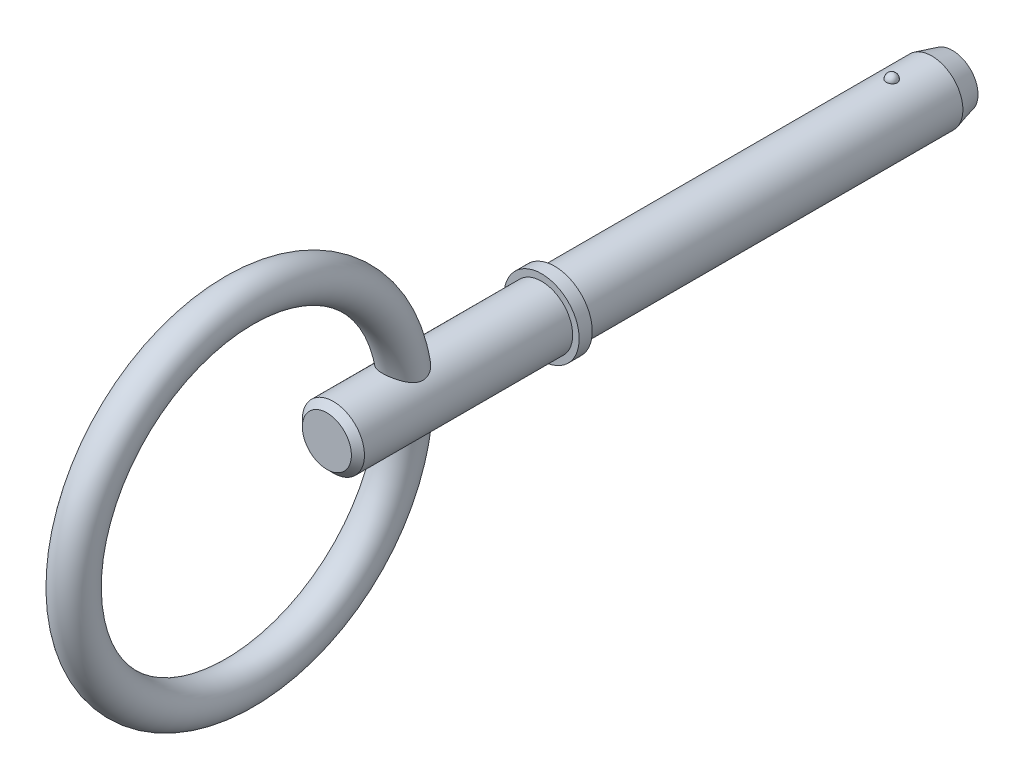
ISO-10303-21;
HEADER;
FILE_DESCRIPTION(('STEP AP214'),'2;1');
FILE_NAME('part.step','',(''),(''),'','','');
FILE_SCHEMA(('AUTOMOTIVE_DESIGN { 1 0 10303 214 1 1 1 1 }'));
ENDSEC;
DATA;
#1=APPLICATION_CONTEXT('core data for automotive mechanical design processes');
#2=APPLICATION_PROTOCOL_DEFINITION('international standard','automotive_design',2000,#1);
#3=PRODUCT_CONTEXT('',#1,'mechanical');
#4=PRODUCT('Part','Part','',(#3));
#5=PRODUCT_RELATED_PRODUCT_CATEGORY('part','',(#4));
#6=PRODUCT_DEFINITION_FORMATION('','',#4);
#7=PRODUCT_DEFINITION_CONTEXT('part definition',#1,'design');
#8=PRODUCT_DEFINITION('design','',#6,#7);
#9=PRODUCT_DEFINITION_SHAPE('','',#8);
#10=(LENGTH_UNIT() NAMED_UNIT(*) SI_UNIT(.MILLI.,.METRE.));
#11=(NAMED_UNIT(*) PLANE_ANGLE_UNIT() SI_UNIT($,.RADIAN.));
#12=(NAMED_UNIT(*) SI_UNIT($,.STERADIAN.) SOLID_ANGLE_UNIT());
#13=UNCERTAINTY_MEASURE_WITH_UNIT(LENGTH_MEASURE(1.E-05),#10,'distance_accuracy_value','');
#14=(GEOMETRIC_REPRESENTATION_CONTEXT(3) GLOBAL_UNCERTAINTY_ASSIGNED_CONTEXT((#13)) GLOBAL_UNIT_ASSIGNED_CONTEXT((#10,
#11,#12)) REPRESENTATION_CONTEXT('',''));
#15=CARTESIAN_POINT('',(0.,0.,0.));
#16=DIRECTION('',(0.,0.,1.));
#17=DIRECTION('',(1.,0.,0.));
#18=AXIS2_PLACEMENT_3D('',#15,#16,#17);
#19=CARTESIAN_POINT('',(0.,0.,25.4));
#20=DIRECTION('',(0.,0.,-1.));
#21=DIRECTION('',(-1.,0.,0.));
#22=AXIS2_PLACEMENT_3D('',#19,#20,#21);
#23=CYLINDRICAL_SURFACE('',#22,2.38);
#24=CARTESIAN_POINT('',(0.418361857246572,2.34294117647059,-0.419999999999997));
#25=CARTESIAN_POINT('',(0.418361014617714,2.34294160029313,-0.396453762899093));
#26=CARTESIAN_POINT('',(0.416399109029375,2.34329426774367,-0.372895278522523));
#27=CARTESIAN_POINT('',(0.408599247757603,2.34466666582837,-0.32643458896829));
#28=CARTESIAN_POINT('',(0.402757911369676,2.34568697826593,-0.303532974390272));
#29=CARTESIAN_POINT('',(0.387358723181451,2.3482789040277,-0.259059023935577));
#30=CARTESIAN_POINT('',(0.377802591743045,2.34985026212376,-0.237486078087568));
#31=CARTESIAN_POINT('',(0.355233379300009,2.35336760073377,-0.196270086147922));
#32=CARTESIAN_POINT('',(0.34222083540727,2.3553135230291,-0.176626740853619));
#33=CARTESIAN_POINT('',(0.313060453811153,2.35936636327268,-0.139777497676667));
#34=CARTESIAN_POINT('',(0.296906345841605,2.36147359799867,-0.122576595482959));
#35=CARTESIAN_POINT('',(0.261921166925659,2.3656092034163,-0.0911421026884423));
#36=CARTESIAN_POINT('',(0.243090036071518,2.36763757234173,-0.0769085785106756));
#37=CARTESIAN_POINT('',(0.203297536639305,2.37138533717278,-0.0518262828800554));
#38=CARTESIAN_POINT('',(0.182338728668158,2.37310509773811,-0.0409735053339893));
#39=CARTESIAN_POINT('',(0.138864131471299,2.37604521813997,-0.0229395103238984));
#40=CARTESIAN_POINT('',(0.116348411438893,2.37726560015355,-0.0157581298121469));
#41=CARTESIAN_POINT('',(0.0705754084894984,2.37906276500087,-0.00531205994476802));
#42=CARTESIAN_POINT('',(0.0473247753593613,2.37964420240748,-0.00201903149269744));
#43=CARTESIAN_POINT('',(0.000593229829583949,2.38011460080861,0.000651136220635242));
#44=CARTESIAN_POINT('',(-0.0228876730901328,2.38000359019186,2.84360175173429E-05));
#45=CARTESIAN_POINT('',(-0.0692686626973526,2.37910422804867,-0.00509943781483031));
#46=CARTESIAN_POINT('',(-0.0921713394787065,2.37831983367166,-0.00958192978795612));
#47=CARTESIAN_POINT('',(-0.136890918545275,2.37616546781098,-0.022272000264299));
#48=CARTESIAN_POINT('',(-0.158707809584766,2.37479549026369,-0.0304796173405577));
#49=CARTESIAN_POINT('',(-0.200704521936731,2.37161607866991,-0.0504168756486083));
#50=CARTESIAN_POINT('',(-0.220879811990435,2.36980547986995,-0.0621558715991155));
#51=CARTESIAN_POINT('',(-0.258974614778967,2.36594575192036,-0.0888218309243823));
#52=CARTESIAN_POINT('',(-0.276894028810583,2.36389661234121,-0.103748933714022));
#53=CARTESIAN_POINT('',(-0.310124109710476,2.35976825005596,-0.136509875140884));
#54=CARTESIAN_POINT('',(-0.325413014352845,2.35768891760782,-0.154365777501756));
#55=CARTESIAN_POINT('',(-0.352793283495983,2.35374782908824,-0.192402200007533));
#56=CARTESIAN_POINT('',(-0.364884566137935,2.35188607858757,-0.212582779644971));
#57=CARTESIAN_POINT('',(-0.385587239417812,2.34858114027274,-0.254794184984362));
#58=CARTESIAN_POINT('',(-0.394183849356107,2.34713973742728,-0.276832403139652));
#59=CARTESIAN_POINT('',(-0.407590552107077,2.3448489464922,-0.322061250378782));
#60=CARTESIAN_POINT('',(-0.412400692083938,2.34399955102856,-0.34525186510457));
#61=CARTESIAN_POINT('',(-0.418098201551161,2.34299005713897,-0.392078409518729));
#62=CARTESIAN_POINT('',(-0.41899328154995,2.34282860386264,-0.415713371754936));
#63=CARTESIAN_POINT('',(-0.416857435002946,2.34320955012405,-0.462799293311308));
#64=CARTESIAN_POINT('',(-0.413826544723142,2.34375194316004,-0.486250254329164));
#65=CARTESIAN_POINT('',(-0.403929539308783,2.34547773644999,-0.532261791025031));
#66=CARTESIAN_POINT('',(-0.397069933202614,2.34666004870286,-0.554823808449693));
#67=CARTESIAN_POINT('',(-0.379705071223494,2.34953208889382,-0.59846383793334));
#68=CARTESIAN_POINT('',(-0.369199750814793,2.35122182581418,-0.61954182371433));
#69=CARTESIAN_POINT('',(-0.344797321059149,2.35492396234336,-0.659671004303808));
#70=CARTESIAN_POINT('',(-0.33089223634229,2.35693711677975,-0.678717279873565));
#71=CARTESIAN_POINT('',(-0.300080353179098,2.36105754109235,-0.714192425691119));
#72=CARTESIAN_POINT('',(-0.283173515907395,2.36316481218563,-0.730621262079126));
#73=CARTESIAN_POINT('',(-0.246801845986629,2.36723962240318,-0.760416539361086));
#74=CARTESIAN_POINT('',(-0.227334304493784,2.36920701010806,-0.773779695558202));
#75=CARTESIAN_POINT('',(-0.186398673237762,2.37277833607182,-0.797042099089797));
#76=CARTESIAN_POINT('',(-0.164930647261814,2.37438228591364,-0.806941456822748));
#77=CARTESIAN_POINT('',(-0.120727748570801,2.37703848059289,-0.82294821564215));
#78=CARTESIAN_POINT('',(-0.0980005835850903,2.37809374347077,-0.829076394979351));
#79=CARTESIAN_POINT('',(-0.0518218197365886,2.37954782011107,-0.837451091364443));
#80=CARTESIAN_POINT('',(-0.0283702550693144,2.37994666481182,-0.839697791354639));
#81=CARTESIAN_POINT('',(0.0184023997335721,2.38004290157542,-0.840243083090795));
#82=CARTESIAN_POINT('',(0.0417231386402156,2.37974556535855,-0.838571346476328));
#83=CARTESIAN_POINT('',(0.0877471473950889,2.37849333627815,-0.831389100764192));
#84=CARTESIAN_POINT('',(0.110450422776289,2.37753844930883,-0.825878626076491));
#85=CARTESIAN_POINT('',(0.154584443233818,2.37507730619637,-0.811179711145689));
#86=CARTESIAN_POINT('',(0.17601599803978,2.37357140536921,-0.801993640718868));
#87=CARTESIAN_POINT('',(0.217028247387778,2.37017355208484,-0.780200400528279));
#88=CARTESIAN_POINT('',(0.236608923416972,2.36828159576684,-0.767593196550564));
#89=CARTESIAN_POINT('',(0.27351405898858,2.36430486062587,-0.739207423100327));
#90=CARTESIAN_POINT('',(0.290821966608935,2.36221883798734,-0.723407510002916));
#91=CARTESIAN_POINT('',(0.322554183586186,2.3580957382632,-0.68912612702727));
#92=CARTESIAN_POINT('',(0.336977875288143,2.35605867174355,-0.670644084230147));
#93=CARTESIAN_POINT('',(0.362636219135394,2.35224677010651,-0.63138169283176));
#94=CARTESIAN_POINT('',(0.373848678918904,2.35047379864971,-0.610586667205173));
#95=CARTESIAN_POINT('',(0.392641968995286,2.34740786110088,-0.567397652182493));
#96=CARTESIAN_POINT('',(0.400225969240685,2.34611447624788,-0.545005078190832));
#97=CARTESIAN_POINT('',(0.410033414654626,2.34441668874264,-0.505456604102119));
#98=CARTESIAN_POINT('',(0.413152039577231,2.34386644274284,-0.488523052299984));
#99=CARTESIAN_POINT('',(0.417316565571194,2.34312853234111,-0.454395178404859));
#100=CARTESIAN_POINT('',(0.418362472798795,2.34294086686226,-0.437200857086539));
#101=CARTESIAN_POINT('',(0.418361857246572,2.34294117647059,-0.419999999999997));
#102=B_SPLINE_CURVE_WITH_KNOTS('',3,(#24,#25,#26,#27,#28,#29,#30,#31,#32,#33,#34,#35,#36,#37,
#38,#39,#40,#41,#42,#43,#44,#45,#46,#47,#48,#49,#50,#51,#52,#53,#54,#55,#56,#57,#58,#59,#60,#61,
#62,#63,#64,#65,#66,#67,#68,#69,#70,#71,#72,#73,#74,#75,#76,#77,#78,#79,#80,#81,#82,#83,#84,#85,
#86,#87,#88,#89,#90,#91,#92,#93,#94,#95,#96,#97,#98,#99,#100,#101),.UNSPECIFIED.,.T.,.F.,(4,2,2,
2,2,2,2,2,2,2,2,2,2,2,2,2,2,2,2,2,2,2,2,2,2,2,2,2,2,2,2,2,2,2,2,2,2,2,4),(0.,0.0705763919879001,
0.141214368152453,0.211819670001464,0.282414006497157,0.353150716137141,0.423889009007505,
0.494543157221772,0.565194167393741,0.635327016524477,0.705456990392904,0.77517764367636,
0.844899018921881,0.914806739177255,0.98471751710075,1.05518143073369,1.1256471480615,
1.19640787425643,1.26716771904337,1.33778814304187,1.40840791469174,1.47890799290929,
1.54940931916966,1.62007764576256,1.69074688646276,1.76149149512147,1.83223384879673,
1.90258285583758,1.97292854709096,2.04274328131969,2.11255738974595,2.18232655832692,
2.25209642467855,2.32234913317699,2.39261687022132,2.4633591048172,2.5340394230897,
2.58559662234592,2.63715366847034),.UNSPECIFIED.);
#103=CARTESIAN_POINT('',(0.418361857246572,2.34294117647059,-0.419999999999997));
#104=VERTEX_POINT('',#103);
#105=EDGE_CURVE('E102',#104,#104,#102,.T.);
#106=ORIENTED_EDGE('',*,*,#105,.T.);
#107=EDGE_LOOP('',(#106));
#108=FACE_BOUND('',#107,.T.);
#109=CARTESIAN_POINT('',(0.,0.,-3.49399999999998));
#110=DIRECTION('',(0.,0.,-1.));
#111=DIRECTION('',(-1.,0.,0.));
#112=AXIS2_PLACEMENT_3D('',#109,#110,#111);
#113=CIRCLE('',#112,2.38);
#114=CARTESIAN_POINT('',(-2.38,0.,-3.49399999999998));
#115=VERTEX_POINT('',#114);
#116=EDGE_CURVE('E109',#115,#115,#113,.F.);
#117=ORIENTED_EDGE('',*,*,#116,.T.);
#118=EDGE_LOOP('',(#117));
#119=FACE_BOUND('',#118,.T.);
#120=CARTESIAN_POINT('',(0.,0.,25.4));
#121=DIRECTION('',(0.,0.,1.));
#122=DIRECTION('',(1.,0.,0.));
#123=AXIS2_PLACEMENT_3D('',#120,#121,#122);
#124=CIRCLE('',#123,2.38);
#125=CARTESIAN_POINT('',(2.38,0.,25.4));
#126=VERTEX_POINT('',#125);
#127=EDGE_CURVE('E107',#126,#126,#124,.T.);
#128=ORIENTED_EDGE('',*,*,#127,.F.);
#129=EDGE_LOOP('',(#128));
#130=FACE_BOUND('',#129,.T.);
#131=ADVANCED_FACE('F39',(#108,#119,#130),#23,.T.);
#132=CARTESIAN_POINT('',(0.,0.,-5.08));
#133=DIRECTION('',(0.,0.,-1.));
#134=DIRECTION('',(-1.,0.,0.));
#135=AXIS2_PLACEMENT_3D('',#132,#133,#134);
#136=PLANE('',#135);
#137=CARTESIAN_POINT('',(0.,0.,-5.08));
#138=DIRECTION('',(0.,0.,-1.));
#139=DIRECTION('',(-1.,0.,0.));
#140=AXIS2_PLACEMENT_3D('',#137,#138,#139);
#141=CIRCLE('',#140,1.95503258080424);
#142=CARTESIAN_POINT('',(-1.95503258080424,0.,-5.08));
#143=VERTEX_POINT('',#142);
#144=EDGE_CURVE('E141',#143,#143,#141,.T.);
#145=ORIENTED_EDGE('',*,*,#144,.T.);
#146=EDGE_LOOP('',(#145));
#147=FACE_BOUND('',#146,.T.);
#148=ADVANCED_FACE('F88',(#147),#136,.T.);
#149=CARTESIAN_POINT('',(0.,0.,-5.08));
#150=DIRECTION('',(0.,0.,1.));
#151=DIRECTION('',(1.,0.,0.));
#152=AXIS2_PLACEMENT_3D('',#149,#150,#151);
#153=CONICAL_SURFACE('',#152,1.95503258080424,0.261799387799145);
#154=ORIENTED_EDGE('',*,*,#116,.F.);
#155=EDGE_LOOP('',(#154));
#156=FACE_BOUND('',#155,.T.);
#157=ORIENTED_EDGE('',*,*,#144,.F.);
#158=EDGE_LOOP('',(#157));
#159=FACE_BOUND('',#158,.T.);
#160=ADVANCED_FACE('F94',(#156,#159),#153,.T.);
#161=CARTESIAN_POINT('',(0.,2.38,-0.419999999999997));
#162=DIRECTION('',(0.,1.,0.));
#163=DIRECTION('',(0.,0.,1.));
#164=AXIS2_PLACEMENT_3D('',#161,#162,#163);
#165=SPHERICAL_SURFACE('',#164,0.419999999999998);
#166=ORIENTED_EDGE('',*,*,#105,.F.);
#167=EDGE_LOOP('',(#166));
#168=FACE_BOUND('',#167,.T.);
#169=ADVANCED_FACE('F112',(#168),#165,.T.);
#170=CARTESIAN_POINT('',(0.,0.,25.4));
#171=DIRECTION('',(0.,0.,-1.));
#172=DIRECTION('',(-1.,0.,0.));
#173=AXIS2_PLACEMENT_3D('',#170,#171,#172);
#174=PLANE('',#173);
#175=ORIENTED_EDGE('',*,*,#127,.T.);
#176=EDGE_LOOP('',(#175));
#177=FACE_BOUND('',#176,.T.);
#178=CARTESIAN_POINT('',(0.,0.,25.4));
#179=DIRECTION('',(0.,0.,-1.));
#180=DIRECTION('',(-1.,0.,0.));
#181=AXIS2_PLACEMENT_3D('',#178,#179,#180);
#182=CIRCLE('',#181,2.88);
#183=CARTESIAN_POINT('',(-2.88,0.,25.4));
#184=VERTEX_POINT('',#183);
#185=EDGE_CURVE('E108',#184,#184,#182,.T.);
#186=ORIENTED_EDGE('',*,*,#185,.T.);
#187=EDGE_LOOP('',(#186));
#188=FACE_BOUND('',#187,.T.);
#189=ADVANCED_FACE('F116',(#177,#188),#174,.T.);
#190=CARTESIAN_POINT('',(0.,0.,33.7287874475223));
#191=DIRECTION('',(0.,0.,-1.));
#192=DIRECTION('',(-1.,0.,0.));
#193=AXIS2_PLACEMENT_3D('',#190,#191,#192);
#194=CYLINDRICAL_SURFACE('',#193,2.88);
#195=CARTESIAN_POINT('',(0.,0.,26.4));
#196=DIRECTION('',(0.,0.,-1.));
#197=DIRECTION('',(-1.,0.,0.));
#198=AXIS2_PLACEMENT_3D('',#195,#196,#197);
#199=CIRCLE('',#198,2.88);
#200=CARTESIAN_POINT('',(-2.88,0.,26.4));
#201=VERTEX_POINT('',#200);
#202=EDGE_CURVE('E133',#201,#201,#199,.T.);
#203=ORIENTED_EDGE('',*,*,#202,.T.);
#204=EDGE_LOOP('',(#203));
#205=FACE_BOUND('',#204,.T.);
#206=ORIENTED_EDGE('',*,*,#185,.F.);
#207=EDGE_LOOP('',(#206));
#208=FACE_BOUND('',#207,.T.);
#209=ADVANCED_FACE('F120',(#205,#208),#194,.T.);
#210=CARTESIAN_POINT('',(0.,2.88,26.4));
#211=DIRECTION('',(0.,0.,1.));
#212=DIRECTION('',(1.,0.,0.));
#213=AXIS2_PLACEMENT_3D('',#210,#211,#212);
#214=PLANE('',#213);
#215=CARTESIAN_POINT('',(0.,0.,26.4));
#216=DIRECTION('',(0.,0.,1.));
#217=DIRECTION('',(1.,0.,0.));
#218=AXIS2_PLACEMENT_3D('',#215,#216,#217);
#219=CIRCLE('',#218,2.38);
#220=CARTESIAN_POINT('',(2.38,0.,26.4));
#221=VERTEX_POINT('',#220);
#222=EDGE_CURVE('E111',#221,#221,#219,.T.);
#223=ORIENTED_EDGE('',*,*,#222,.F.);
#224=EDGE_LOOP('',(#223));
#225=FACE_BOUND('',#224,.T.);
#226=ORIENTED_EDGE('',*,*,#202,.F.);
#227=EDGE_LOOP('',(#226));
#228=FACE_BOUND('',#227,.T.);
#229=ADVANCED_FACE('F85',(#225,#228),#214,.T.);
#230=CARTESIAN_POINT('',(0.,0.,42.85));
#231=DIRECTION('',(0.,0.,-1.));
#232=DIRECTION('',(-1.,0.,0.));
#233=AXIS2_PLACEMENT_3D('',#230,#231,#232);
#234=CYLINDRICAL_SURFACE('',#233,2.38);
#235=CARTESIAN_POINT('',(-0.903407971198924,-2.20187511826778,35.828101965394));
#236=CARTESIAN_POINT('',(-0.8397103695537,-2.22800560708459,35.7836275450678));
#237=CARTESIAN_POINT('',(-0.771955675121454,-2.25255828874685,35.7439200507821));
#238=CARTESIAN_POINT('',(-0.629623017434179,-2.29641711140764,35.6749006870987));
#239=CARTESIAN_POINT('',(-0.555034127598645,-2.31571464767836,35.6456058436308));
#240=CARTESIAN_POINT('',(-0.400673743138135,-2.34735542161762,35.5982943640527));
#241=CARTESIAN_POINT('',(-0.320887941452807,-2.35967847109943,35.5803104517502));
#242=CARTESIAN_POINT('',(-0.15873829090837,-2.37609587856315,35.5564617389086));
#243=CARTESIAN_POINT('',(-0.0763765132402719,-2.38019668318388,35.5505874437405));
#244=CARTESIAN_POINT('',(0.0836658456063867,-2.3797998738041,35.5511603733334));
#245=CARTESIAN_POINT('',(0.161351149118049,-2.37576936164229,35.5569382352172));
#246=CARTESIAN_POINT('',(0.314409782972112,-2.36039486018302,35.5792676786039));
#247=CARTESIAN_POINT('',(0.389782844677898,-2.34905002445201,35.5958205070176));
#248=CARTESIAN_POINT('',(0.535937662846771,-2.32006569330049,35.6390515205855));
#249=CARTESIAN_POINT('',(0.606735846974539,-2.30245039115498,35.6656908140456));
#250=CARTESIAN_POINT('',(0.742521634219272,-2.26231731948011,35.7283720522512));
#251=CARTESIAN_POINT('',(0.807508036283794,-2.23979853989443,35.7644159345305));
#252=CARTESIAN_POINT('',(0.935326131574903,-2.18966592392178,35.8483563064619));
#253=CARTESIAN_POINT('',(0.997591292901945,-2.16179128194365,35.8969595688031));
#254=CARTESIAN_POINT('',(1.11292144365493,-2.10474548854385,36.0035603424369));
#255=CARTESIAN_POINT('',(1.16597568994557,-2.07557287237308,36.0615686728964));
#256=CARTESIAN_POINT('',(1.26477130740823,-2.01699124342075,36.1902977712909));
#257=CARTESIAN_POINT('',(1.30983402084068,-1.98768494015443,36.2615920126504));
#258=CARTESIAN_POINT('',(1.38660631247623,-1.93491744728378,36.4129637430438));
#259=CARTESIAN_POINT('',(1.41834090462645,-1.91144534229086,36.4930244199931));
#260=CARTESIAN_POINT('',(1.46422131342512,-1.87648847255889,36.6506940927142));
#261=CARTESIAN_POINT('',(1.47990731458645,-1.86397592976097,36.7276190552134));
#262=CARTESIAN_POINT('',(1.49871691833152,-1.84889326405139,36.8838974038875));
#263=CARTESIAN_POINT('',(1.50185388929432,-1.84631256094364,36.9632481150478));
#264=CARTESIAN_POINT('',(1.4964844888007,-1.85065563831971,37.1088470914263));
#265=CARTESIAN_POINT('',(1.48970686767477,-1.85616871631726,37.1752204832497));
#266=CARTESIAN_POINT('',(1.46828795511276,-1.87315650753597,37.3059075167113));
#267=CARTESIAN_POINT('',(1.4536391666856,-1.88463690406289,37.3702191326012));
#268=CARTESIAN_POINT('',(1.40943250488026,-1.91806137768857,37.5230643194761));
#269=CARTESIAN_POINT('',(1.3761634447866,-1.94238425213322,37.6099991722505));
#270=CARTESIAN_POINT('',(1.29708737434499,-1.99605834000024,37.7763485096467));
#271=CARTESIAN_POINT('',(1.25125268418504,-2.02542060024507,37.855745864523));
#272=CARTESIAN_POINT('',(1.14695036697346,-2.08629729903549,38.0076285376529));
#273=CARTESIAN_POINT('',(1.08823347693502,-2.11784433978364,38.0799296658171));
#274=CARTESIAN_POINT('',(0.959228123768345,-2.17930599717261,38.2140708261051));
#275=CARTESIAN_POINT('',(0.888958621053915,-2.20922318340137,38.2759276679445));
#276=CARTESIAN_POINT('',(0.753368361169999,-2.25851185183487,38.3749333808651));
#277=CARTESIAN_POINT('',(0.690173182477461,-2.2787729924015,38.4145392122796));
#278=CARTESIAN_POINT('',(0.557409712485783,-2.31482439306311,38.4839846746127));
#279=CARTESIAN_POINT('',(0.487846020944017,-2.33061784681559,38.5138312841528));
#280=CARTESIAN_POINT('',(0.342953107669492,-2.35631858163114,38.5620255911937));
#281=CARTESIAN_POINT('',(0.267574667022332,-2.36616750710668,38.580259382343));
#282=CARTESIAN_POINT('',(0.114199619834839,-2.37849775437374,38.6030468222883));
#283=CARTESIAN_POINT('',(0.0362059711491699,-2.3809871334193,38.6076154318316));
#284=CARTESIAN_POINT('',(-0.107568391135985,-2.37849121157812,38.6030163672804));
#285=CARTESIAN_POINT('',(-0.173440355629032,-2.37456249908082,38.595790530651));
#286=CARTESIAN_POINT('',(-0.302853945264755,-2.36154811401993,38.5716908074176));
#287=CARTESIAN_POINT('',(-0.366395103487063,-2.35246141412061,38.5548149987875));
#288=CARTESIAN_POINT('',(-0.489880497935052,-2.32988758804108,38.5124346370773));
#289=CARTESIAN_POINT('',(-0.549812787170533,-2.31638670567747,38.4869031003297));
#290=CARTESIAN_POINT('',(-0.665021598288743,-2.28597979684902,38.428489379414));
#291=CARTESIAN_POINT('',(-0.720295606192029,-2.26907194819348,38.3956032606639));
#292=CARTESIAN_POINT('',(-0.851132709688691,-2.22413718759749,38.3063110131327));
#293=CARTESIAN_POINT('',(-0.923680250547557,-2.19467168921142,38.2461969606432));
#294=CARTESIAN_POINT('',(-1.05722916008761,-2.13356097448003,38.1150668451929));
#295=CARTESIAN_POINT('',(-1.11820078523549,-2.10191042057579,38.0440235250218));
#296=CARTESIAN_POINT('',(-1.22894457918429,-2.0391654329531,37.8916118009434));
#297=CARTESIAN_POINT('',(-1.27853191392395,-2.00808682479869,37.8101025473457));
#298=CARTESIAN_POINT('',(-1.36422650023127,-1.95088121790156,37.6387530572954));
#299=CARTESIAN_POINT('',(-1.40036235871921,-1.9247437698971,37.5489310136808));
#300=CARTESIAN_POINT('',(-1.44943039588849,-1.88791548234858,37.3877392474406));
#301=CARTESIAN_POINT('',(-1.46600167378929,-1.87495651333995,37.3180059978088));
#302=CARTESIAN_POINT('',(-1.48984634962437,-1.8560704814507,37.1760551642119));
#303=CARTESIAN_POINT('',(-1.49713400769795,-1.85013263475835,37.103841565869));
#304=CARTESIAN_POINT('',(-1.5014924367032,-1.84660099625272,36.9583634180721));
#305=CARTESIAN_POINT('',(-1.49849436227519,-1.84906342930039,36.8850950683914));
#306=CARTESIAN_POINT('',(-1.48179888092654,-1.8624661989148,36.7405680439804));
#307=CARTESIAN_POINT('',(-1.46809860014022,-1.87340881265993,36.669309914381));
#308=CARTESIAN_POINT('',(-1.43218989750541,-1.90096973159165,36.5372815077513));
#309=CARTESIAN_POINT('',(-1.410850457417,-1.91699396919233,36.4761429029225));
#310=CARTESIAN_POINT('',(-1.36038958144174,-1.95312601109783,36.3584385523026));
#311=CARTESIAN_POINT('',(-1.33126141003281,-1.97323734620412,36.3018768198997));
#312=CARTESIAN_POINT('',(-1.26173108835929,-2.0185059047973,36.1870500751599));
#313=CARTESIAN_POINT('',(-1.22036168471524,-2.0439794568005,36.1294985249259));
#314=CARTESIAN_POINT('',(-1.12954254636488,-2.09553139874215,36.0216488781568));
#315=CARTESIAN_POINT('',(-1.0801042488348,-2.12160888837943,35.9713407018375));
#316=CARTESIAN_POINT('',(-0.987769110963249,-2.16578285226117,35.8904848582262));
#317=CARTESIAN_POINT('',(-0.946517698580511,-2.18419033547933,35.8582016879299));
#318=CARTESIAN_POINT('',(-0.903407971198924,-2.20187511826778,35.828101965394));
#319=B_SPLINE_CURVE_WITH_KNOTS('',3,(#235,#236,#237,#238,#239,#240,#241,#242,#243,#244,#245,
#246,#247,#248,#249,#250,#251,#252,#253,#254,#255,#256,#257,#258,#259,#260,#261,#262,#263,#264,
#265,#266,#267,#268,#269,#270,#271,#272,#273,#274,#275,#276,#277,#278,#279,#280,#281,#282,#283,
#284,#285,#286,#287,#288,#289,#290,#291,#292,#293,#294,#295,#296,#297,#298,#299,#300,#301,#302,
#303,#304,#305,#306,#307,#308,#309,#310,#311,#312,#313,#314,#315,#316,#317,#318),.UNSPECIFIED.,
.T.,.F.,(4,2,2,2,2,2,2,2,2,2,2,2,2,2,2,2,2,2,2,2,2,2,2,2,2,2,2,2,2,2,2,2,2,2,2,2,2,2,2,2,2,4),
(0.,0.245727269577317,0.491854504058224,0.738690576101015,0.985333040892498,1.21821047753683,
1.45111486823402,1.68313021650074,1.91519340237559,2.16541572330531,2.41592795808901,
2.68235417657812,2.94827811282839,3.18521517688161,3.42189976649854,3.6219115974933,
3.82211427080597,4.10918949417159,4.39690224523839,4.69076958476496,4.98415935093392,
5.21515577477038,5.44598665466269,5.67904815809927,5.91185441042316,6.11003726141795,
6.3082595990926,6.50710565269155,6.70605834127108,7.00062466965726,7.29593791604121,
7.59575158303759,7.89492395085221,8.11262207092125,8.32998539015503,8.54880641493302,
8.76768621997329,8.96702101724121,9.16652875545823,9.39164791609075,9.61645071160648,
9.78275580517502),.UNSPECIFIED.);
#320=CARTESIAN_POINT('',(-0.903407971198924,-2.20187511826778,35.828101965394));
#321=VERTEX_POINT('',#320);
#322=EDGE_CURVE('E10',#321,#321,#319,.T.);
#323=ORIENTED_EDGE('',*,*,#322,.F.);
#324=EDGE_LOOP('',(#323));
#325=FACE_BOUND('',#324,.T.);
#326=CARTESIAN_POINT('',(-0.903407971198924,2.20187511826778,35.828101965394));
#327=CARTESIAN_POINT('',(-0.970214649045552,2.17445928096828,35.8747550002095));
#328=CARTESIAN_POINT('',(-1.03268838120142,2.14525344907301,35.9267440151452));
#329=CARTESIAN_POINT('',(-1.1477077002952,2.0859961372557,36.0406478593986));
#330=CARTESIAN_POINT('',(-1.20022114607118,2.05594226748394,36.1025936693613));
#331=CARTESIAN_POINT('',(-1.2941155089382,1.99817720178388,36.2359266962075));
#332=CARTESIAN_POINT('',(-1.33544720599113,1.9704767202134,36.3073536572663));
#333=CARTESIAN_POINT('',(-1.40506760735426,1.92146090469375,36.4582024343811));
#334=CARTESIAN_POINT('',(-1.43339046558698,1.90012890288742,36.5376026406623));
#335=CARTESIAN_POINT('',(-1.47338334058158,1.86925714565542,36.6934496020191));
#336=CARTESIAN_POINT('',(-1.48649837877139,1.85870842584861,36.7693198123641));
#337=CARTESIAN_POINT('',(-1.50071746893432,1.8472518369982,36.92287045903));
#338=CARTESIAN_POINT('',(-1.50182784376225,1.84633889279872,37.0005499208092));
#339=CARTESIAN_POINT('',(-1.49326645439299,1.85325786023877,37.1439859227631));
#340=CARTESIAN_POINT('',(-1.48506604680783,1.85989666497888,37.2099043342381));
#341=CARTESIAN_POINT('',(-1.46099386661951,1.87886395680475,37.3394790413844));
#342=CARTESIAN_POINT('',(-1.44511553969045,1.8911973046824,37.4031333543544));
#343=CARTESIAN_POINT('',(-1.39754250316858,1.92678855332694,37.5561538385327));
#344=CARTESIAN_POINT('',(-1.36192725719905,1.95245999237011,37.6437372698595));
#345=CARTESIAN_POINT('',(-1.27788657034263,2.00847209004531,37.8109907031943));
#346=CARTESIAN_POINT('',(-1.22943137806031,2.0388235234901,37.8906417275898));
#347=CARTESIAN_POINT('',(-1.11958027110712,2.10119412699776,38.0424206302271));
#348=CARTESIAN_POINT('',(-1.05794784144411,2.13323438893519,38.1143690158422));
#349=CARTESIAN_POINT('',(-0.922772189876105,2.1950849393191,38.2470807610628));
#350=CARTESIAN_POINT('',(-0.849252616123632,2.22489948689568,38.3078658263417));
#351=CARTESIAN_POINT('',(-0.710152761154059,2.27246326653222,38.4023110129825));
#352=CARTESIAN_POINT('',(-0.647015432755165,2.29138112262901,38.4389704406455));
#353=CARTESIAN_POINT('',(-0.514878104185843,2.32463484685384,38.5025884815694));
#354=CARTESIAN_POINT('',(-0.445882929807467,2.33897444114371,38.5295549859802));
#355=CARTESIAN_POINT('',(-0.302797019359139,2.36177853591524,38.5721624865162));
#356=CARTESIAN_POINT('',(-0.228666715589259,2.37019011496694,38.5877015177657));
#357=CARTESIAN_POINT('',(-0.0783799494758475,2.37989644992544,38.6056164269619));
#358=CARTESIAN_POINT('',(-0.00222521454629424,2.38119708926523,38.6080031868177));
#359=CARTESIAN_POINT('',(0.138818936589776,2.37685303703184,38.5999981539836));
#360=CARTESIAN_POINT('',(0.203841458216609,2.37212211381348,38.5912876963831));
#361=CARTESIAN_POINT('',(0.33134774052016,2.35769527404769,38.5645309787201));
#362=CARTESIAN_POINT('',(0.393830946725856,2.34799827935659,38.5464826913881));
#363=CARTESIAN_POINT('',(0.516206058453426,2.32419976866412,38.5016833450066));
#364=CARTESIAN_POINT('',(0.576015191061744,2.31000942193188,38.4747562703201));
#365=CARTESIAN_POINT('',(0.690806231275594,2.27831963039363,38.4136110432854));
#366=CARTESIAN_POINT('',(0.745785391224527,2.26081831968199,38.379388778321));
#367=CARTESIAN_POINT('',(0.876071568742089,2.2144370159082,38.2866108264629));
#368=CARTESIAN_POINT('',(0.948236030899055,2.18416686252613,38.224322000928));
#369=CARTESIAN_POINT('',(1.08068664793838,2.121767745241,38.0888044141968));
#370=CARTESIAN_POINT('',(1.14094076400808,2.08963406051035,38.015547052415));
#371=CARTESIAN_POINT('',(1.24978363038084,2.02643655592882,37.858659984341));
#372=CARTESIAN_POINT('',(1.29819307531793,1.99539463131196,37.7748968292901));
#373=CARTESIAN_POINT('',(1.38094965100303,1.93904233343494,37.5989962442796));
#374=CARTESIAN_POINT('',(1.41533296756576,1.91371728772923,37.5068811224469));
#375=CARTESIAN_POINT('',(1.46011713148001,1.879629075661,37.343926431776));
#376=CARTESIAN_POINT('',(1.47459501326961,1.86818653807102,37.2747778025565));
#377=CARTESIAN_POINT('',(1.49436605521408,1.8524142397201,37.134403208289));
#378=CARTESIAN_POINT('',(1.49967306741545,1.84807375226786,37.0631805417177));
#379=CARTESIAN_POINT('',(1.50029887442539,1.84756805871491,36.9202291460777));
#380=CARTESIAN_POINT('',(1.49556248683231,1.8514480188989,36.848499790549));
#381=CARTESIAN_POINT('',(1.47581657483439,1.86722196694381,36.7073512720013));
#382=CARTESIAN_POINT('',(1.46080121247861,1.87912050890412,36.6379334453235));
#383=CARTESIAN_POINT('',(1.42246467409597,1.90827733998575,36.5082199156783));
#384=CARTESIAN_POINT('',(1.39980172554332,1.92509995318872,36.4476260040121));
#385=CARTESIAN_POINT('',(1.34679091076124,1.9625508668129,36.3311857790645));
#386=CARTESIAN_POINT('',(1.31644034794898,1.98318050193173,36.2753411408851));
#387=CARTESIAN_POINT('',(1.24396057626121,2.02954647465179,36.1614514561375));
#388=CARTESIAN_POINT('',(1.20077385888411,2.05559269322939,36.1042068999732));
#389=CARTESIAN_POINT('',(1.10616417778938,2.10801594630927,35.9971320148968));
#390=CARTESIAN_POINT('',(1.05473535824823,2.13439320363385,35.9473070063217));
#391=CARTESIAN_POINT('',(0.936202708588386,2.18924478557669,35.8487347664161));
#392=CARTESIAN_POINT('',(0.867904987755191,2.21744450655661,35.8012583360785));
#393=CARTESIAN_POINT('',(0.722917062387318,2.26885521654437,35.7177494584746));
#394=CARTESIAN_POINT('',(0.646227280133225,2.29206645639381,35.6817164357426));
#395=CARTESIAN_POINT('',(0.487515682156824,2.33094430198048,35.622591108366));
#396=CARTESIAN_POINT('',(0.405587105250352,2.34671524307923,35.5993190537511));
#397=CARTESIAN_POINT('',(0.23795558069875,2.36958127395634,35.5658521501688));
#398=CARTESIAN_POINT('',(0.152255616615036,2.37668309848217,35.5556471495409));
#399=CARTESIAN_POINT('',(-0.0122990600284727,2.38126478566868,35.5490505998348));
#400=CARTESIAN_POINT('',(-0.0910885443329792,2.37954037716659,35.5515167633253));
#401=CARTESIAN_POINT('',(-0.247004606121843,2.36843740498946,35.5675699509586));
#402=CARTESIAN_POINT('',(-0.324130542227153,2.35905594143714,35.5811611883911));
#403=CARTESIAN_POINT('',(-0.473048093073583,2.33371594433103,35.6185984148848));
#404=CARTESIAN_POINT('',(-0.544914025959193,2.31788812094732,35.6422409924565));
#405=CARTESIAN_POINT('',(-0.683201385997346,2.28095222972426,35.6990265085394));
#406=CARTESIAN_POINT('',(-0.749631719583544,2.25985303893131,35.7321534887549));
#407=CARTESIAN_POINT('',(-0.843767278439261,2.22565914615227,35.7880726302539));
#408=CARTESIAN_POINT('',(-0.874007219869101,2.21394047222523,35.8075705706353));
#409=CARTESIAN_POINT('',(-0.903407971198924,2.20187511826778,35.828101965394));
#410=B_SPLINE_CURVE_WITH_KNOTS('',3,(#326,#327,#328,#329,#330,#331,#332,#333,#334,#335,#336,
#337,#338,#339,#340,#341,#342,#343,#344,#345,#346,#347,#348,#349,#350,#351,#352,#353,#354,#355,
#356,#357,#358,#359,#360,#361,#362,#363,#364,#365,#366,#367,#368,#369,#370,#371,#372,#373,#374,
#375,#376,#377,#378,#379,#380,#381,#382,#383,#384,#385,#386,#387,#388,#389,#390,#391,#392,#393,
#394,#395,#396,#397,#398,#399,#400,#401,#402,#403,#404,#405,#406,#407,#408,#409),.UNSPECIFIED.,
.T.,.F.,(4,2,2,2,2,2,2,2,2,2,2,2,2,2,2,2,2,2,2,2,2,2,2,2,2,2,2,2,2,2,2,2,2,2,2,2,2,2,2,2,2,4),
(0.,0.257815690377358,0.516449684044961,0.776204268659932,1.03527292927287,1.26692758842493,
1.49846022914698,1.69794041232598,1.89759118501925,2.18993090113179,2.4829540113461,
2.78175997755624,3.07997865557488,3.30539912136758,3.53063565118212,3.75785831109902,
3.98489294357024,4.1812829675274,4.37771564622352,4.57830350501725,4.77900474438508,
5.07746482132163,5.37671714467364,5.68025255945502,5.98299985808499,6.19688795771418,
6.41045270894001,6.62519390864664,6.84005717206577,7.03981304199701,7.23963907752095,
7.46764796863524,7.69581957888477,7.95804669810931,8.2202606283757,8.47867938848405,
8.73689726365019,8.97226876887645,9.20772945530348,9.43863631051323,9.66915690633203,
9.7826182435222),.UNSPECIFIED.);
#411=CARTESIAN_POINT('',(-0.903407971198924,2.20187511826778,35.828101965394));
#412=VERTEX_POINT('',#411);
#413=EDGE_CURVE('E51',#412,#412,#410,.T.);
#414=ORIENTED_EDGE('',*,*,#413,.F.);
#415=EDGE_LOOP('',(#414));
#416=FACE_BOUND('',#415,.T.);
#417=CARTESIAN_POINT('',(0.,0.,42.35));
#418=DIRECTION('',(0.,0.,-1.));
#419=DIRECTION('',(-1.,0.,0.));
#420=AXIS2_PLACEMENT_3D('',#417,#418,#419);
#421=CIRCLE('',#420,2.38);
#422=CARTESIAN_POINT('',(-2.38,0.,42.35));
#423=VERTEX_POINT('',#422);
#424=EDGE_CURVE('E64',#423,#423,#421,.T.);
#425=ORIENTED_EDGE('',*,*,#424,.T.);
#426=EDGE_LOOP('',(#425));
#427=FACE_BOUND('',#426,.T.);
#428=ORIENTED_EDGE('',*,*,#222,.T.);
#429=EDGE_LOOP('',(#428));
#430=FACE_BOUND('',#429,.T.);
#431=ADVANCED_FACE('F69',(#325,#416,#427,#430),#234,.T.);
#432=CARTESIAN_POINT('',(0.,0.,42.85));
#433=DIRECTION('',(0.,0.,-1.));
#434=DIRECTION('',(-1.,0.,0.));
#435=AXIS2_PLACEMENT_3D('',#432,#433,#434);
#436=PLANE('',#435);
#437=CARTESIAN_POINT('',(0.,0.,42.85));
#438=DIRECTION('',(0.,0.,-1.));
#439=DIRECTION('',(-1.,0.,0.));
#440=AXIS2_PLACEMENT_3D('',#437,#438,#439);
#441=CIRCLE('',#440,1.88);
#442=CARTESIAN_POINT('',(-1.88,0.,42.85));
#443=VERTEX_POINT('',#442);
#444=EDGE_CURVE('E57',#443,#443,#441,.F.);
#445=ORIENTED_EDGE('',*,*,#444,.T.);
#446=EDGE_LOOP('',(#445));
#447=FACE_BOUND('',#446,.T.);
#448=ADVANCED_FACE('F76',(#447),#436,.F.);
#449=CARTESIAN_POINT('',(0.,0.,42.35));
#450=DIRECTION('',(0.,0.,-1.));
#451=DIRECTION('',(-1.,0.,0.));
#452=AXIS2_PLACEMENT_3D('',#449,#450,#451);
#453=CONICAL_SURFACE('',#452,2.38,0.785398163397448);
#454=ORIENTED_EDGE('',*,*,#444,.F.);
#455=EDGE_LOOP('',(#454));
#456=FACE_BOUND('',#455,.T.);
#457=ORIENTED_EDGE('',*,*,#424,.F.);
#458=EDGE_LOOP('',(#457));
#459=FACE_BOUND('',#458,.T.);
#460=ADVANCED_FACE('F41',(#456,#459),#453,.T.);
#461=CARTESIAN_POINT('',(0.,0.,49.55));
#462=DIRECTION('',(1.,0.,0.));
#463=DIRECTION('',(0.,0.,-1.));
#464=AXIS2_PLACEMENT_3D('',#461,#462,#463);
#465=TOROIDAL_SURFACE('',#464,12.7,1.5);
#466=ORIENTED_EDGE('',*,*,#322,.T.);
#467=EDGE_LOOP('',(#466));
#468=FACE_BOUND('',#467,.T.);
#469=ORIENTED_EDGE('',*,*,#413,.T.);
#470=EDGE_LOOP('',(#469));
#471=FACE_BOUND('',#470,.T.);
#472=ADVANCED_FACE('F73',(#468,#471),#465,.T.);
#473=CLOSED_SHELL('',(#131,#148,#160,#169,#189,#209,#229,#431,#448,#460,#472));
#474=MANIFOLD_SOLID_BREP('B2',#473);
#475=ADVANCED_BREP_SHAPE_REPRESENTATION('',(#18,#474),#14);
#476=SHAPE_DEFINITION_REPRESENTATION(#9,#475);
ENDSEC;
END-ISO-10303-21;
